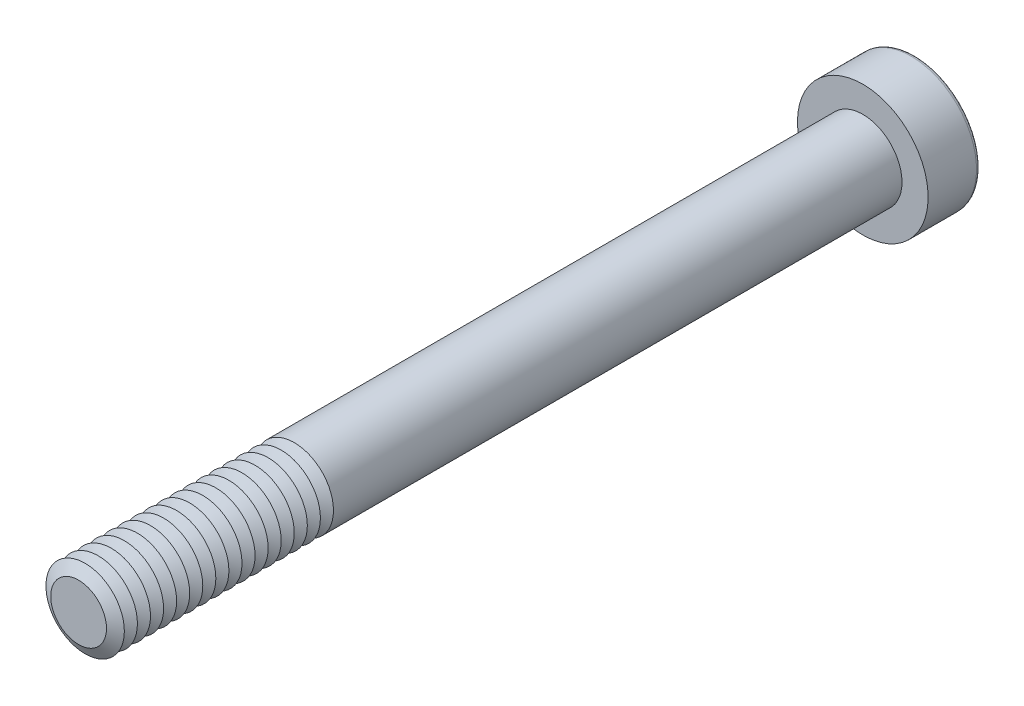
ISO-10303-21;
HEADER;
FILE_DESCRIPTION(('STEP AP214'),'2;1');
FILE_NAME('part.step','',(''),(''),'','','');
FILE_SCHEMA(('AUTOMOTIVE_DESIGN { 1 0 10303 214 1 1 1 1 }'));
ENDSEC;
DATA;
#1=APPLICATION_CONTEXT('core data for automotive mechanical design processes');
#2=APPLICATION_PROTOCOL_DEFINITION('international standard','automotive_design',2000,#1);
#3=PRODUCT_CONTEXT('',#1,'mechanical');
#4=PRODUCT('Part','Part','',(#3));
#5=PRODUCT_RELATED_PRODUCT_CATEGORY('part','',(#4));
#6=PRODUCT_DEFINITION_FORMATION('','',#4);
#7=PRODUCT_DEFINITION_CONTEXT('part definition',#1,'design');
#8=PRODUCT_DEFINITION('design','',#6,#7);
#9=PRODUCT_DEFINITION_SHAPE('','',#8);
#10=(LENGTH_UNIT() NAMED_UNIT(*) SI_UNIT(.MILLI.,.METRE.));
#11=(NAMED_UNIT(*) PLANE_ANGLE_UNIT() SI_UNIT($,.RADIAN.));
#12=(NAMED_UNIT(*) SI_UNIT($,.STERADIAN.) SOLID_ANGLE_UNIT());
#13=UNCERTAINTY_MEASURE_WITH_UNIT(LENGTH_MEASURE(1.E-05),#10,'distance_accuracy_value','');
#14=(GEOMETRIC_REPRESENTATION_CONTEXT(3) GLOBAL_UNCERTAINTY_ASSIGNED_CONTEXT((#13)) GLOBAL_UNIT_ASSIGNED_CONTEXT((#10,
#11,#12)) REPRESENTATION_CONTEXT('',''));
#15=CARTESIAN_POINT('',(0.,0.,0.));
#16=DIRECTION('',(0.,0.,1.));
#17=DIRECTION('',(1.,0.,0.));
#18=AXIS2_PLACEMENT_3D('',#15,#16,#17);
#19=CARTESIAN_POINT('',(0.,0.,56.5));
#20=DIRECTION('',(0.,0.,1.));
#21=DIRECTION('',(1.,0.,0.));
#22=AXIS2_PLACEMENT_3D('',#19,#20,#21);
#23=CONICAL_SURFACE('',#22,3.,1.0471975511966);
#24=CARTESIAN_POINT('',(0.,0.,56.));
#25=DIRECTION('',(0.,0.,1.));
#26=DIRECTION('',(1.,0.,0.));
#27=AXIS2_PLACEMENT_3D('',#24,#25,#26);
#28=CIRCLE('',#27,2.13397459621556);
#29=CARTESIAN_POINT('',(2.13397459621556,0.,56.));
#30=VERTEX_POINT('',#29);
#31=EDGE_CURVE('E313',#30,#30,#28,.T.);
#32=ORIENTED_EDGE('',*,*,#31,.T.);
#33=EDGE_LOOP('',(#32));
#34=FACE_BOUND('',#33,.T.);
#35=CARTESIAN_POINT('',(0.,0.,56.5));
#36=DIRECTION('',(0.,0.,1.));
#37=DIRECTION('',(1.,0.,0.));
#38=AXIS2_PLACEMENT_3D('',#35,#36,#37);
#39=CIRCLE('',#38,3.);
#40=CARTESIAN_POINT('',(3.,0.,56.5));
#41=VERTEX_POINT('',#40);
#42=EDGE_CURVE('E315',#41,#41,#39,.T.);
#43=ORIENTED_EDGE('',*,*,#42,.F.);
#44=EDGE_LOOP('',(#43));
#45=FACE_BOUND('',#44,.T.);
#46=ADVANCED_FACE('F39',(#34,#45),#23,.T.);
#47=CARTESIAN_POINT('',(0.,0.,56.));
#48=DIRECTION('',(0.,0.,-1.));
#49=DIRECTION('',(-1.,0.,0.));
#50=AXIS2_PLACEMENT_3D('',#47,#48,#49);
#51=CONICAL_SURFACE('',#50,2.13397459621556,1.0471975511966);
#52=CARTESIAN_POINT('',(0.,0.,55.5));
#53=DIRECTION('',(0.,0.,1.));
#54=DIRECTION('',(1.,0.,0.));
#55=AXIS2_PLACEMENT_3D('',#52,#53,#54);
#56=CIRCLE('',#55,3.);
#57=CARTESIAN_POINT('',(3.,0.,55.5));
#58=VERTEX_POINT('',#57);
#59=EDGE_CURVE('E323',#58,#58,#56,.T.);
#60=ORIENTED_EDGE('',*,*,#59,.T.);
#61=EDGE_LOOP('',(#60));
#62=FACE_BOUND('',#61,.T.);
#63=ORIENTED_EDGE('',*,*,#31,.F.);
#64=EDGE_LOOP('',(#63));
#65=FACE_BOUND('',#64,.T.);
#66=ADVANCED_FACE('F245',(#62,#65),#51,.T.);
#67=CARTESIAN_POINT('',(0.,0.,60.));
#68=DIRECTION('',(0.,0.,1.));
#69=DIRECTION('',(1.,0.,0.));
#70=AXIS2_PLACEMENT_3D('',#67,#68,#69);
#71=PLANE('',#70);
#72=CARTESIAN_POINT('',(0.,0.,60.));
#73=DIRECTION('',(0.,0.,1.));
#74=DIRECTION('',(1.,0.,0.));
#75=AXIS2_PLACEMENT_3D('',#72,#73,#74);
#76=CIRCLE('',#75,2.13397459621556);
#77=CARTESIAN_POINT('',(2.13397459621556,0.,60.));
#78=VERTEX_POINT('',#77);
#79=EDGE_CURVE('E174',#78,#78,#76,.T.);
#80=ORIENTED_EDGE('',*,*,#79,.T.);
#81=EDGE_LOOP('',(#80));
#82=FACE_BOUND('',#81,.T.);
#83=ADVANCED_FACE('F251',(#82),#71,.T.);
#84=CARTESIAN_POINT('',(0.,0.,60.));
#85=DIRECTION('',(0.,0.,-1.));
#86=DIRECTION('',(-1.,0.,0.));
#87=AXIS2_PLACEMENT_3D('',#84,#85,#86);
#88=CONICAL_SURFACE('',#87,2.13397459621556,1.0471975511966);
#89=CARTESIAN_POINT('',(0.,0.,59.5));
#90=DIRECTION('',(0.,0.,1.));
#91=DIRECTION('',(1.,0.,0.));
#92=AXIS2_PLACEMENT_3D('',#89,#90,#91);
#93=CIRCLE('',#92,3.);
#94=CARTESIAN_POINT('',(3.,0.,59.5));
#95=VERTEX_POINT('',#94);
#96=EDGE_CURVE('E291',#95,#95,#93,.T.);
#97=ORIENTED_EDGE('',*,*,#96,.T.);
#98=EDGE_LOOP('',(#97));
#99=FACE_BOUND('',#98,.T.);
#100=ORIENTED_EDGE('',*,*,#79,.F.);
#101=EDGE_LOOP('',(#100));
#102=FACE_BOUND('',#101,.T.);
#103=ADVANCED_FACE('F199',(#99,#102),#88,.T.);
#104=CARTESIAN_POINT('',(0.,0.,59.5));
#105=DIRECTION('',(0.,0.,1.));
#106=DIRECTION('',(1.,0.,0.));
#107=AXIS2_PLACEMENT_3D('',#104,#105,#106);
#108=CONICAL_SURFACE('',#107,3.,1.0471975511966);
#109=CARTESIAN_POINT('',(0.,0.,59.));
#110=DIRECTION('',(0.,0.,1.));
#111=DIRECTION('',(1.,0.,0.));
#112=AXIS2_PLACEMENT_3D('',#109,#110,#111);
#113=CIRCLE('',#112,2.13397459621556);
#114=CARTESIAN_POINT('',(2.13397459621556,0.,59.));
#115=VERTEX_POINT('',#114);
#116=EDGE_CURVE('E288',#115,#115,#113,.T.);
#117=ORIENTED_EDGE('',*,*,#116,.T.);
#118=EDGE_LOOP('',(#117));
#119=FACE_BOUND('',#118,.T.);
#120=ORIENTED_EDGE('',*,*,#96,.F.);
#121=EDGE_LOOP('',(#120));
#122=FACE_BOUND('',#121,.T.);
#123=ADVANCED_FACE('F277',(#119,#122),#108,.T.);
#124=CARTESIAN_POINT('',(0.,0.,59.));
#125=DIRECTION('',(0.,0.,-1.));
#126=DIRECTION('',(-1.,0.,0.));
#127=AXIS2_PLACEMENT_3D('',#124,#125,#126);
#128=CONICAL_SURFACE('',#127,2.13397459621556,1.0471975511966);
#129=CARTESIAN_POINT('',(0.,0.,58.5));
#130=DIRECTION('',(0.,0.,1.));
#131=DIRECTION('',(1.,0.,0.));
#132=AXIS2_PLACEMENT_3D('',#129,#130,#131);
#133=CIRCLE('',#132,3.);
#134=CARTESIAN_POINT('',(3.,0.,58.5));
#135=VERTEX_POINT('',#134);
#136=EDGE_CURVE('E300',#135,#135,#133,.T.);
#137=ORIENTED_EDGE('',*,*,#136,.T.);
#138=EDGE_LOOP('',(#137));
#139=FACE_BOUND('',#138,.T.);
#140=ORIENTED_EDGE('',*,*,#116,.F.);
#141=EDGE_LOOP('',(#140));
#142=FACE_BOUND('',#141,.T.);
#143=ADVANCED_FACE('F274',(#139,#142),#128,.T.);
#144=CARTESIAN_POINT('',(0.,0.,58.5));
#145=DIRECTION('',(0.,0.,1.));
#146=DIRECTION('',(1.,0.,0.));
#147=AXIS2_PLACEMENT_3D('',#144,#145,#146);
#148=CONICAL_SURFACE('',#147,3.,1.0471975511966);
#149=CARTESIAN_POINT('',(0.,0.,58.));
#150=DIRECTION('',(0.,0.,1.));
#151=DIRECTION('',(1.,0.,0.));
#152=AXIS2_PLACEMENT_3D('',#149,#150,#151);
#153=CIRCLE('',#152,2.13397459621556);
#154=CARTESIAN_POINT('',(2.13397459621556,0.,58.));
#155=VERTEX_POINT('',#154);
#156=EDGE_CURVE('E293',#155,#155,#153,.T.);
#157=ORIENTED_EDGE('',*,*,#156,.T.);
#158=EDGE_LOOP('',(#157));
#159=FACE_BOUND('',#158,.T.);
#160=ORIENTED_EDGE('',*,*,#136,.F.);
#161=EDGE_LOOP('',(#160));
#162=FACE_BOUND('',#161,.T.);
#163=ADVANCED_FACE('F270',(#159,#162),#148,.T.);
#164=CARTESIAN_POINT('',(0.,0.,58.));
#165=DIRECTION('',(0.,0.,-1.));
#166=DIRECTION('',(-1.,0.,0.));
#167=AXIS2_PLACEMENT_3D('',#164,#165,#166);
#168=CONICAL_SURFACE('',#167,2.13397459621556,1.0471975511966);
#169=CARTESIAN_POINT('',(0.,0.,57.5));
#170=DIRECTION('',(0.,0.,1.));
#171=DIRECTION('',(1.,0.,0.));
#172=AXIS2_PLACEMENT_3D('',#169,#170,#171);
#173=CIRCLE('',#172,3.);
#174=CARTESIAN_POINT('',(3.,0.,57.5));
#175=VERTEX_POINT('',#174);
#176=EDGE_CURVE('E309',#175,#175,#173,.T.);
#177=ORIENTED_EDGE('',*,*,#176,.T.);
#178=EDGE_LOOP('',(#177));
#179=FACE_BOUND('',#178,.T.);
#180=ORIENTED_EDGE('',*,*,#156,.F.);
#181=EDGE_LOOP('',(#180));
#182=FACE_BOUND('',#181,.T.);
#183=ADVANCED_FACE('F266',(#179,#182),#168,.T.);
#184=CARTESIAN_POINT('',(0.,0.,57.5));
#185=DIRECTION('',(0.,0.,1.));
#186=DIRECTION('',(1.,0.,0.));
#187=AXIS2_PLACEMENT_3D('',#184,#185,#186);
#188=CONICAL_SURFACE('',#187,3.,1.0471975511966);
#189=CARTESIAN_POINT('',(0.,0.,57.));
#190=DIRECTION('',(0.,0.,1.));
#191=DIRECTION('',(1.,0.,0.));
#192=AXIS2_PLACEMENT_3D('',#189,#190,#191);
#193=CIRCLE('',#192,2.13397459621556);
#194=CARTESIAN_POINT('',(2.13397459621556,0.,57.));
#195=VERTEX_POINT('',#194);
#196=EDGE_CURVE('E306',#195,#195,#193,.T.);
#197=ORIENTED_EDGE('',*,*,#196,.T.);
#198=EDGE_LOOP('',(#197));
#199=FACE_BOUND('',#198,.T.);
#200=ORIENTED_EDGE('',*,*,#176,.F.);
#201=EDGE_LOOP('',(#200));
#202=FACE_BOUND('',#201,.T.);
#203=ADVANCED_FACE('F262',(#199,#202),#188,.T.);
#204=CARTESIAN_POINT('',(0.,0.,57.));
#205=DIRECTION('',(0.,0.,-1.));
#206=DIRECTION('',(-1.,0.,0.));
#207=AXIS2_PLACEMENT_3D('',#204,#205,#206);
#208=CONICAL_SURFACE('',#207,2.13397459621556,1.0471975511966);
#209=ORIENTED_EDGE('',*,*,#42,.T.);
#210=EDGE_LOOP('',(#209));
#211=FACE_BOUND('',#210,.T.);
#212=ORIENTED_EDGE('',*,*,#196,.F.);
#213=EDGE_LOOP('',(#212));
#214=FACE_BOUND('',#213,.T.);
#215=ADVANCED_FACE('F258',(#211,#214),#208,.T.);
#216=CARTESIAN_POINT('',(0.,0.,55.5));
#217=DIRECTION('',(0.,0.,1.));
#218=DIRECTION('',(1.,0.,0.));
#219=AXIS2_PLACEMENT_3D('',#216,#217,#218);
#220=CONICAL_SURFACE('',#219,3.,1.0471975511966);
#221=CARTESIAN_POINT('',(0.,0.,55.));
#222=DIRECTION('',(0.,0.,1.));
#223=DIRECTION('',(1.,0.,0.));
#224=AXIS2_PLACEMENT_3D('',#221,#222,#223);
#225=CIRCLE('',#224,2.13397459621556);
#226=CARTESIAN_POINT('',(2.13397459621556,0.,55.));
#227=VERTEX_POINT('',#226);
#228=EDGE_CURVE('E319',#227,#227,#225,.T.);
#229=ORIENTED_EDGE('',*,*,#228,.T.);
#230=EDGE_LOOP('',(#229));
#231=FACE_BOUND('',#230,.T.);
#232=ORIENTED_EDGE('',*,*,#59,.F.);
#233=EDGE_LOOP('',(#232));
#234=FACE_BOUND('',#233,.T.);
#235=ADVANCED_FACE('F261',(#231,#234),#220,.T.);
#236=CARTESIAN_POINT('',(0.,0.,55.));
#237=DIRECTION('',(0.,0.,-1.));
#238=DIRECTION('',(-1.,0.,0.));
#239=AXIS2_PLACEMENT_3D('',#236,#237,#238);
#240=CONICAL_SURFACE('',#239,2.13397459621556,1.0471975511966);
#241=CARTESIAN_POINT('',(0.,0.,54.5));
#242=DIRECTION('',(0.,0.,1.));
#243=DIRECTION('',(1.,0.,0.));
#244=AXIS2_PLACEMENT_3D('',#241,#242,#243);
#245=CIRCLE('',#244,3.);
#246=CARTESIAN_POINT('',(3.,0.,54.5));
#247=VERTEX_POINT('',#246);
#248=EDGE_CURVE('E331',#247,#247,#245,.T.);
#249=ORIENTED_EDGE('',*,*,#248,.T.);
#250=EDGE_LOOP('',(#249));
#251=FACE_BOUND('',#250,.T.);
#252=ORIENTED_EDGE('',*,*,#228,.F.);
#253=EDGE_LOOP('',(#252));
#254=FACE_BOUND('',#253,.T.);
#255=ADVANCED_FACE('F511',(#251,#254),#240,.T.);
#256=CARTESIAN_POINT('',(0.,0.,54.5));
#257=DIRECTION('',(0.,0.,1.));
#258=DIRECTION('',(1.,0.,0.));
#259=AXIS2_PLACEMENT_3D('',#256,#257,#258);
#260=CONICAL_SURFACE('',#259,3.,1.0471975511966);
#261=CARTESIAN_POINT('',(0.,0.,54.));
#262=DIRECTION('',(0.,0.,1.));
#263=DIRECTION('',(1.,0.,0.));
#264=AXIS2_PLACEMENT_3D('',#261,#262,#263);
#265=CIRCLE('',#264,2.13397459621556);
#266=CARTESIAN_POINT('',(2.13397459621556,0.,54.));
#267=VERTEX_POINT('',#266);
#268=EDGE_CURVE('E327',#267,#267,#265,.T.);
#269=ORIENTED_EDGE('',*,*,#268,.T.);
#270=EDGE_LOOP('',(#269));
#271=FACE_BOUND('',#270,.T.);
#272=ORIENTED_EDGE('',*,*,#248,.F.);
#273=EDGE_LOOP('',(#272));
#274=FACE_BOUND('',#273,.T.);
#275=ADVANCED_FACE('F507',(#271,#274),#260,.T.);
#276=CARTESIAN_POINT('',(0.,0.,54.));
#277=DIRECTION('',(0.,0.,-1.));
#278=DIRECTION('',(-1.,0.,0.));
#279=AXIS2_PLACEMENT_3D('',#276,#277,#278);
#280=CONICAL_SURFACE('',#279,2.13397459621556,1.0471975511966);
#281=CARTESIAN_POINT('',(0.,0.,53.5));
#282=DIRECTION('',(0.,0.,1.));
#283=DIRECTION('',(1.,0.,0.));
#284=AXIS2_PLACEMENT_3D('',#281,#282,#283);
#285=CIRCLE('',#284,3.);
#286=CARTESIAN_POINT('',(3.,0.,53.5));
#287=VERTEX_POINT('',#286);
#288=EDGE_CURVE('E339',#287,#287,#285,.T.);
#289=ORIENTED_EDGE('',*,*,#288,.T.);
#290=EDGE_LOOP('',(#289));
#291=FACE_BOUND('',#290,.T.);
#292=ORIENTED_EDGE('',*,*,#268,.F.);
#293=EDGE_LOOP('',(#292));
#294=FACE_BOUND('',#293,.T.);
#295=ADVANCED_FACE('F503',(#291,#294),#280,.T.);
#296=CARTESIAN_POINT('',(0.,0.,53.5));
#297=DIRECTION('',(0.,0.,1.));
#298=DIRECTION('',(1.,0.,0.));
#299=AXIS2_PLACEMENT_3D('',#296,#297,#298);
#300=CONICAL_SURFACE('',#299,3.,1.0471975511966);
#301=CARTESIAN_POINT('',(0.,0.,53.));
#302=DIRECTION('',(0.,0.,1.));
#303=DIRECTION('',(1.,0.,0.));
#304=AXIS2_PLACEMENT_3D('',#301,#302,#303);
#305=CIRCLE('',#304,2.13397459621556);
#306=CARTESIAN_POINT('',(2.13397459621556,0.,53.));
#307=VERTEX_POINT('',#306);
#308=EDGE_CURVE('E335',#307,#307,#305,.T.);
#309=ORIENTED_EDGE('',*,*,#308,.T.);
#310=EDGE_LOOP('',(#309));
#311=FACE_BOUND('',#310,.T.);
#312=ORIENTED_EDGE('',*,*,#288,.F.);
#313=EDGE_LOOP('',(#312));
#314=FACE_BOUND('',#313,.T.);
#315=ADVANCED_FACE('F499',(#311,#314),#300,.T.);
#316=CARTESIAN_POINT('',(0.,0.,53.));
#317=DIRECTION('',(0.,0.,-1.));
#318=DIRECTION('',(-1.,0.,0.));
#319=AXIS2_PLACEMENT_3D('',#316,#317,#318);
#320=CONICAL_SURFACE('',#319,2.13397459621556,1.0471975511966);
#321=CARTESIAN_POINT('',(0.,0.,52.5));
#322=DIRECTION('',(0.,0.,1.));
#323=DIRECTION('',(1.,0.,0.));
#324=AXIS2_PLACEMENT_3D('',#321,#322,#323);
#325=CIRCLE('',#324,3.);
#326=CARTESIAN_POINT('',(3.,0.,52.5));
#327=VERTEX_POINT('',#326);
#328=EDGE_CURVE('E347',#327,#327,#325,.T.);
#329=ORIENTED_EDGE('',*,*,#328,.T.);
#330=EDGE_LOOP('',(#329));
#331=FACE_BOUND('',#330,.T.);
#332=ORIENTED_EDGE('',*,*,#308,.F.);
#333=EDGE_LOOP('',(#332));
#334=FACE_BOUND('',#333,.T.);
#335=ADVANCED_FACE('F495',(#331,#334),#320,.T.);
#336=CARTESIAN_POINT('',(0.,0.,52.5));
#337=DIRECTION('',(0.,0.,1.));
#338=DIRECTION('',(1.,0.,0.));
#339=AXIS2_PLACEMENT_3D('',#336,#337,#338);
#340=CONICAL_SURFACE('',#339,3.,1.0471975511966);
#341=CARTESIAN_POINT('',(0.,0.,52.));
#342=DIRECTION('',(0.,0.,1.));
#343=DIRECTION('',(1.,0.,0.));
#344=AXIS2_PLACEMENT_3D('',#341,#342,#343);
#345=CIRCLE('',#344,2.13397459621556);
#346=CARTESIAN_POINT('',(2.13397459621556,0.,52.));
#347=VERTEX_POINT('',#346);
#348=EDGE_CURVE('E343',#347,#347,#345,.T.);
#349=ORIENTED_EDGE('',*,*,#348,.T.);
#350=EDGE_LOOP('',(#349));
#351=FACE_BOUND('',#350,.T.);
#352=ORIENTED_EDGE('',*,*,#328,.F.);
#353=EDGE_LOOP('',(#352));
#354=FACE_BOUND('',#353,.T.);
#355=ADVANCED_FACE('F491',(#351,#354),#340,.T.);
#356=CARTESIAN_POINT('',(0.,0.,52.));
#357=DIRECTION('',(0.,0.,-1.));
#358=DIRECTION('',(-1.,0.,0.));
#359=AXIS2_PLACEMENT_3D('',#356,#357,#358);
#360=CONICAL_SURFACE('',#359,2.13397459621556,1.0471975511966);
#361=CARTESIAN_POINT('',(0.,0.,51.5));
#362=DIRECTION('',(0.,0.,1.));
#363=DIRECTION('',(1.,0.,0.));
#364=AXIS2_PLACEMENT_3D('',#361,#362,#363);
#365=CIRCLE('',#364,3.);
#366=CARTESIAN_POINT('',(3.,0.,51.5));
#367=VERTEX_POINT('',#366);
#368=EDGE_CURVE('E355',#367,#367,#365,.T.);
#369=ORIENTED_EDGE('',*,*,#368,.T.);
#370=EDGE_LOOP('',(#369));
#371=FACE_BOUND('',#370,.T.);
#372=ORIENTED_EDGE('',*,*,#348,.F.);
#373=EDGE_LOOP('',(#372));
#374=FACE_BOUND('',#373,.T.);
#375=ADVANCED_FACE('F487',(#371,#374),#360,.T.);
#376=CARTESIAN_POINT('',(0.,0.,51.5));
#377=DIRECTION('',(0.,0.,1.));
#378=DIRECTION('',(1.,0.,0.));
#379=AXIS2_PLACEMENT_3D('',#376,#377,#378);
#380=CONICAL_SURFACE('',#379,3.,1.0471975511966);
#381=CARTESIAN_POINT('',(0.,0.,51.));
#382=DIRECTION('',(0.,0.,1.));
#383=DIRECTION('',(1.,0.,0.));
#384=AXIS2_PLACEMENT_3D('',#381,#382,#383);
#385=CIRCLE('',#384,2.13397459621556);
#386=CARTESIAN_POINT('',(2.13397459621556,0.,51.));
#387=VERTEX_POINT('',#386);
#388=EDGE_CURVE('E351',#387,#387,#385,.T.);
#389=ORIENTED_EDGE('',*,*,#388,.T.);
#390=EDGE_LOOP('',(#389));
#391=FACE_BOUND('',#390,.T.);
#392=ORIENTED_EDGE('',*,*,#368,.F.);
#393=EDGE_LOOP('',(#392));
#394=FACE_BOUND('',#393,.T.);
#395=ADVANCED_FACE('F483',(#391,#394),#380,.T.);
#396=CARTESIAN_POINT('',(0.,0.,51.));
#397=DIRECTION('',(0.,0.,-1.));
#398=DIRECTION('',(-1.,0.,0.));
#399=AXIS2_PLACEMENT_3D('',#396,#397,#398);
#400=CONICAL_SURFACE('',#399,2.13397459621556,1.0471975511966);
#401=CARTESIAN_POINT('',(0.,0.,50.5));
#402=DIRECTION('',(0.,0.,1.));
#403=DIRECTION('',(1.,0.,0.));
#404=AXIS2_PLACEMENT_3D('',#401,#402,#403);
#405=CIRCLE('',#404,3.);
#406=CARTESIAN_POINT('',(3.,0.,50.5));
#407=VERTEX_POINT('',#406);
#408=EDGE_CURVE('E363',#407,#407,#405,.T.);
#409=ORIENTED_EDGE('',*,*,#408,.T.);
#410=EDGE_LOOP('',(#409));
#411=FACE_BOUND('',#410,.T.);
#412=ORIENTED_EDGE('',*,*,#388,.F.);
#413=EDGE_LOOP('',(#412));
#414=FACE_BOUND('',#413,.T.);
#415=ADVANCED_FACE('F479',(#411,#414),#400,.T.);
#416=CARTESIAN_POINT('',(0.,0.,50.5));
#417=DIRECTION('',(0.,0.,1.));
#418=DIRECTION('',(1.,0.,0.));
#419=AXIS2_PLACEMENT_3D('',#416,#417,#418);
#420=CONICAL_SURFACE('',#419,3.,1.0471975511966);
#421=CARTESIAN_POINT('',(0.,0.,50.));
#422=DIRECTION('',(0.,0.,1.));
#423=DIRECTION('',(1.,0.,0.));
#424=AXIS2_PLACEMENT_3D('',#421,#422,#423);
#425=CIRCLE('',#424,2.13397459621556);
#426=CARTESIAN_POINT('',(2.13397459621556,0.,50.));
#427=VERTEX_POINT('',#426);
#428=EDGE_CURVE('E359',#427,#427,#425,.T.);
#429=ORIENTED_EDGE('',*,*,#428,.T.);
#430=EDGE_LOOP('',(#429));
#431=FACE_BOUND('',#430,.T.);
#432=ORIENTED_EDGE('',*,*,#408,.F.);
#433=EDGE_LOOP('',(#432));
#434=FACE_BOUND('',#433,.T.);
#435=ADVANCED_FACE('F475',(#431,#434),#420,.T.);
#436=CARTESIAN_POINT('',(0.,0.,50.));
#437=DIRECTION('',(0.,0.,-1.));
#438=DIRECTION('',(-1.,0.,0.));
#439=AXIS2_PLACEMENT_3D('',#436,#437,#438);
#440=CONICAL_SURFACE('',#439,2.13397459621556,1.0471975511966);
#441=CARTESIAN_POINT('',(0.,0.,49.5));
#442=DIRECTION('',(0.,0.,1.));
#443=DIRECTION('',(1.,0.,0.));
#444=AXIS2_PLACEMENT_3D('',#441,#442,#443);
#445=CIRCLE('',#444,3.);
#446=CARTESIAN_POINT('',(3.,0.,49.5));
#447=VERTEX_POINT('',#446);
#448=EDGE_CURVE('E371',#447,#447,#445,.T.);
#449=ORIENTED_EDGE('',*,*,#448,.T.);
#450=EDGE_LOOP('',(#449));
#451=FACE_BOUND('',#450,.T.);
#452=ORIENTED_EDGE('',*,*,#428,.F.);
#453=EDGE_LOOP('',(#452));
#454=FACE_BOUND('',#453,.T.);
#455=ADVANCED_FACE('F471',(#451,#454),#440,.T.);
#456=CARTESIAN_POINT('',(0.,0.,49.5));
#457=DIRECTION('',(0.,0.,1.));
#458=DIRECTION('',(1.,0.,0.));
#459=AXIS2_PLACEMENT_3D('',#456,#457,#458);
#460=CONICAL_SURFACE('',#459,3.,1.0471975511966);
#461=CARTESIAN_POINT('',(0.,0.,49.));
#462=DIRECTION('',(0.,0.,1.));
#463=DIRECTION('',(1.,0.,0.));
#464=AXIS2_PLACEMENT_3D('',#461,#462,#463);
#465=CIRCLE('',#464,2.13397459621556);
#466=CARTESIAN_POINT('',(2.13397459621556,0.,49.));
#467=VERTEX_POINT('',#466);
#468=EDGE_CURVE('E367',#467,#467,#465,.T.);
#469=ORIENTED_EDGE('',*,*,#468,.T.);
#470=EDGE_LOOP('',(#469));
#471=FACE_BOUND('',#470,.T.);
#472=ORIENTED_EDGE('',*,*,#448,.F.);
#473=EDGE_LOOP('',(#472));
#474=FACE_BOUND('',#473,.T.);
#475=ADVANCED_FACE('F467',(#471,#474),#460,.T.);
#476=CARTESIAN_POINT('',(0.,0.,49.));
#477=DIRECTION('',(0.,0.,-1.));
#478=DIRECTION('',(-1.,0.,0.));
#479=AXIS2_PLACEMENT_3D('',#476,#477,#478);
#480=CONICAL_SURFACE('',#479,2.13397459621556,1.0471975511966);
#481=CARTESIAN_POINT('',(0.,0.,48.5));
#482=DIRECTION('',(0.,0.,1.));
#483=DIRECTION('',(1.,0.,0.));
#484=AXIS2_PLACEMENT_3D('',#481,#482,#483);
#485=CIRCLE('',#484,3.);
#486=CARTESIAN_POINT('',(3.,0.,48.5));
#487=VERTEX_POINT('',#486);
#488=EDGE_CURVE('E379',#487,#487,#485,.T.);
#489=ORIENTED_EDGE('',*,*,#488,.T.);
#490=EDGE_LOOP('',(#489));
#491=FACE_BOUND('',#490,.T.);
#492=ORIENTED_EDGE('',*,*,#468,.F.);
#493=EDGE_LOOP('',(#492));
#494=FACE_BOUND('',#493,.T.);
#495=ADVANCED_FACE('F463',(#491,#494),#480,.T.);
#496=CARTESIAN_POINT('',(0.,0.,48.5));
#497=DIRECTION('',(0.,0.,1.));
#498=DIRECTION('',(1.,0.,0.));
#499=AXIS2_PLACEMENT_3D('',#496,#497,#498);
#500=CONICAL_SURFACE('',#499,3.,1.0471975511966);
#501=CARTESIAN_POINT('',(0.,0.,48.));
#502=DIRECTION('',(0.,0.,1.));
#503=DIRECTION('',(1.,0.,0.));
#504=AXIS2_PLACEMENT_3D('',#501,#502,#503);
#505=CIRCLE('',#504,2.13397459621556);
#506=CARTESIAN_POINT('',(2.13397459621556,0.,48.));
#507=VERTEX_POINT('',#506);
#508=EDGE_CURVE('E375',#507,#507,#505,.T.);
#509=ORIENTED_EDGE('',*,*,#508,.T.);
#510=EDGE_LOOP('',(#509));
#511=FACE_BOUND('',#510,.T.);
#512=ORIENTED_EDGE('',*,*,#488,.F.);
#513=EDGE_LOOP('',(#512));
#514=FACE_BOUND('',#513,.T.);
#515=ADVANCED_FACE('F459',(#511,#514),#500,.T.);
#516=CARTESIAN_POINT('',(0.,0.,48.));
#517=DIRECTION('',(0.,0.,-1.));
#518=DIRECTION('',(-1.,0.,0.));
#519=AXIS2_PLACEMENT_3D('',#516,#517,#518);
#520=CONICAL_SURFACE('',#519,2.13397459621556,1.0471975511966);
#521=CARTESIAN_POINT('',(0.,0.,47.5));
#522=DIRECTION('',(0.,0.,1.));
#523=DIRECTION('',(1.,0.,0.));
#524=AXIS2_PLACEMENT_3D('',#521,#522,#523);
#525=CIRCLE('',#524,3.);
#526=CARTESIAN_POINT('',(3.,0.,47.5));
#527=VERTEX_POINT('',#526);
#528=EDGE_CURVE('E387',#527,#527,#525,.T.);
#529=ORIENTED_EDGE('',*,*,#528,.T.);
#530=EDGE_LOOP('',(#529));
#531=FACE_BOUND('',#530,.T.);
#532=ORIENTED_EDGE('',*,*,#508,.F.);
#533=EDGE_LOOP('',(#532));
#534=FACE_BOUND('',#533,.T.);
#535=ADVANCED_FACE('F455',(#531,#534),#520,.T.);
#536=CARTESIAN_POINT('',(0.,0.,47.5));
#537=DIRECTION('',(0.,0.,1.));
#538=DIRECTION('',(1.,0.,0.));
#539=AXIS2_PLACEMENT_3D('',#536,#537,#538);
#540=CONICAL_SURFACE('',#539,3.,1.0471975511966);
#541=CARTESIAN_POINT('',(0.,0.,47.));
#542=DIRECTION('',(0.,0.,1.));
#543=DIRECTION('',(1.,0.,0.));
#544=AXIS2_PLACEMENT_3D('',#541,#542,#543);
#545=CIRCLE('',#544,2.13397459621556);
#546=CARTESIAN_POINT('',(2.13397459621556,0.,47.));
#547=VERTEX_POINT('',#546);
#548=EDGE_CURVE('E383',#547,#547,#545,.T.);
#549=ORIENTED_EDGE('',*,*,#548,.T.);
#550=EDGE_LOOP('',(#549));
#551=FACE_BOUND('',#550,.T.);
#552=ORIENTED_EDGE('',*,*,#528,.F.);
#553=EDGE_LOOP('',(#552));
#554=FACE_BOUND('',#553,.T.);
#555=ADVANCED_FACE('F451',(#551,#554),#540,.T.);
#556=CARTESIAN_POINT('',(0.,0.,47.));
#557=DIRECTION('',(0.,0.,-1.));
#558=DIRECTION('',(-1.,0.,0.));
#559=AXIS2_PLACEMENT_3D('',#556,#557,#558);
#560=CONICAL_SURFACE('',#559,2.13397459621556,1.0471975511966);
#561=CARTESIAN_POINT('',(0.,0.,46.5));
#562=DIRECTION('',(0.,0.,1.));
#563=DIRECTION('',(1.,0.,0.));
#564=AXIS2_PLACEMENT_3D('',#561,#562,#563);
#565=CIRCLE('',#564,3.);
#566=CARTESIAN_POINT('',(3.,0.,46.5));
#567=VERTEX_POINT('',#566);
#568=EDGE_CURVE('E395',#567,#567,#565,.T.);
#569=ORIENTED_EDGE('',*,*,#568,.T.);
#570=EDGE_LOOP('',(#569));
#571=FACE_BOUND('',#570,.T.);
#572=ORIENTED_EDGE('',*,*,#548,.F.);
#573=EDGE_LOOP('',(#572));
#574=FACE_BOUND('',#573,.T.);
#575=ADVANCED_FACE('F447',(#571,#574),#560,.T.);
#576=CARTESIAN_POINT('',(0.,0.,46.5));
#577=DIRECTION('',(0.,0.,1.));
#578=DIRECTION('',(1.,0.,0.));
#579=AXIS2_PLACEMENT_3D('',#576,#577,#578);
#580=CONICAL_SURFACE('',#579,3.,1.0471975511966);
#581=CARTESIAN_POINT('',(0.,0.,46.));
#582=DIRECTION('',(0.,0.,1.));
#583=DIRECTION('',(1.,0.,0.));
#584=AXIS2_PLACEMENT_3D('',#581,#582,#583);
#585=CIRCLE('',#584,2.13397459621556);
#586=CARTESIAN_POINT('',(2.13397459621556,0.,46.));
#587=VERTEX_POINT('',#586);
#588=EDGE_CURVE('E391',#587,#587,#585,.T.);
#589=ORIENTED_EDGE('',*,*,#588,.T.);
#590=EDGE_LOOP('',(#589));
#591=FACE_BOUND('',#590,.T.);
#592=ORIENTED_EDGE('',*,*,#568,.F.);
#593=EDGE_LOOP('',(#592));
#594=FACE_BOUND('',#593,.T.);
#595=ADVANCED_FACE('F443',(#591,#594),#580,.T.);
#596=CARTESIAN_POINT('',(0.,0.,46.));
#597=DIRECTION('',(0.,0.,-1.));
#598=DIRECTION('',(-1.,0.,0.));
#599=AXIS2_PLACEMENT_3D('',#596,#597,#598);
#600=CONICAL_SURFACE('',#599,2.13397459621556,1.0471975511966);
#601=CARTESIAN_POINT('',(0.,0.,45.5));
#602=DIRECTION('',(0.,0.,1.));
#603=DIRECTION('',(1.,0.,0.));
#604=AXIS2_PLACEMENT_3D('',#601,#602,#603);
#605=CIRCLE('',#604,3.);
#606=CARTESIAN_POINT('',(3.,0.,45.5));
#607=VERTEX_POINT('',#606);
#608=EDGE_CURVE('E403',#607,#607,#605,.T.);
#609=ORIENTED_EDGE('',*,*,#608,.T.);
#610=EDGE_LOOP('',(#609));
#611=FACE_BOUND('',#610,.T.);
#612=ORIENTED_EDGE('',*,*,#588,.F.);
#613=EDGE_LOOP('',(#612));
#614=FACE_BOUND('',#613,.T.);
#615=ADVANCED_FACE('F439',(#611,#614),#600,.T.);
#616=CARTESIAN_POINT('',(0.,0.,45.5));
#617=DIRECTION('',(0.,0.,1.));
#618=DIRECTION('',(1.,0.,0.));
#619=AXIS2_PLACEMENT_3D('',#616,#617,#618);
#620=CONICAL_SURFACE('',#619,3.,1.0471975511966);
#621=CARTESIAN_POINT('',(0.,0.,45.));
#622=DIRECTION('',(0.,0.,1.));
#623=DIRECTION('',(1.,0.,0.));
#624=AXIS2_PLACEMENT_3D('',#621,#622,#623);
#625=CIRCLE('',#624,2.13397459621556);
#626=CARTESIAN_POINT('',(2.13397459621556,0.,45.));
#627=VERTEX_POINT('',#626);
#628=EDGE_CURVE('E399',#627,#627,#625,.T.);
#629=ORIENTED_EDGE('',*,*,#628,.T.);
#630=EDGE_LOOP('',(#629));
#631=FACE_BOUND('',#630,.T.);
#632=ORIENTED_EDGE('',*,*,#608,.F.);
#633=EDGE_LOOP('',(#632));
#634=FACE_BOUND('',#633,.T.);
#635=ADVANCED_FACE('F434',(#631,#634),#620,.T.);
#636=CARTESIAN_POINT('',(0.,0.,45.));
#637=DIRECTION('',(0.,0.,-1.));
#638=DIRECTION('',(-1.,0.,0.));
#639=AXIS2_PLACEMENT_3D('',#636,#637,#638);
#640=CONICAL_SURFACE('',#639,2.13397459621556,1.0471975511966);
#641=CARTESIAN_POINT('',(0.,0.,44.5));
#642=DIRECTION('',(0.,0.,1.));
#643=DIRECTION('',(1.,0.,0.));
#644=AXIS2_PLACEMENT_3D('',#641,#642,#643);
#645=CIRCLE('',#644,3.);
#646=CARTESIAN_POINT('',(3.,0.,44.5));
#647=VERTEX_POINT('',#646);
#648=EDGE_CURVE('E415',#647,#647,#645,.T.);
#649=ORIENTED_EDGE('',*,*,#648,.T.);
#650=EDGE_LOOP('',(#649));
#651=FACE_BOUND('',#650,.T.);
#652=ORIENTED_EDGE('',*,*,#628,.F.);
#653=EDGE_LOOP('',(#652));
#654=FACE_BOUND('',#653,.T.);
#655=ADVANCED_FACE('F420',(#651,#654),#640,.T.);
#656=CARTESIAN_POINT('',(0.,0.,44.5));
#657=DIRECTION('',(0.,0.,1.));
#658=DIRECTION('',(1.,0.,0.));
#659=AXIS2_PLACEMENT_3D('',#656,#657,#658);
#660=CONICAL_SURFACE('',#659,3.,1.0471975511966);
#661=CARTESIAN_POINT('',(0.,0.,44.));
#662=DIRECTION('',(0.,0.,1.));
#663=DIRECTION('',(1.,0.,0.));
#664=AXIS2_PLACEMENT_3D('',#661,#662,#663);
#665=CIRCLE('',#664,2.13397459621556);
#666=CARTESIAN_POINT('',(2.13397459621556,0.,44.));
#667=VERTEX_POINT('',#666);
#668=EDGE_CURVE('E407',#667,#667,#665,.T.);
#669=ORIENTED_EDGE('',*,*,#668,.T.);
#670=EDGE_LOOP('',(#669));
#671=FACE_BOUND('',#670,.T.);
#672=ORIENTED_EDGE('',*,*,#648,.F.);
#673=EDGE_LOOP('',(#672));
#674=FACE_BOUND('',#673,.T.);
#675=ADVANCED_FACE('F423',(#671,#674),#660,.T.);
#676=CARTESIAN_POINT('',(0.,0.,44.));
#677=DIRECTION('',(0.,0.,-1.));
#678=DIRECTION('',(-1.,0.,0.));
#679=AXIS2_PLACEMENT_3D('',#676,#677,#678);
#680=CONICAL_SURFACE('',#679,2.13397459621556,1.0471975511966);
#681=CARTESIAN_POINT('',(0.,0.,43.5));
#682=DIRECTION('',(0.,0.,1.));
#683=DIRECTION('',(1.,0.,0.));
#684=AXIS2_PLACEMENT_3D('',#681,#682,#683);
#685=CIRCLE('',#684,3.);
#686=CARTESIAN_POINT('',(3.,0.,43.5));
#687=VERTEX_POINT('',#686);
#688=EDGE_CURVE('E411',#687,#687,#685,.T.);
#689=ORIENTED_EDGE('',*,*,#688,.T.);
#690=EDGE_LOOP('',(#689));
#691=FACE_BOUND('',#690,.T.);
#692=ORIENTED_EDGE('',*,*,#668,.F.);
#693=EDGE_LOOP('',(#692));
#694=FACE_BOUND('',#693,.T.);
#695=ADVANCED_FACE('F425',(#691,#694),#680,.T.);
#696=CARTESIAN_POINT('',(0.,0.,-1.));
#697=DIRECTION('',(0.,0.,-1.));
#698=DIRECTION('',(-1.,0.,0.));
#699=AXIS2_PLACEMENT_3D('',#696,#697,#698);
#700=CONICAL_SURFACE('',#699,2.,1.0471975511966);
#701=CARTESIAN_POINT('',(0.,0.,0.154700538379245));
#702=VERTEX_POINT('',#701);
#703=VERTEX_LOOP('',#702);
#704=FACE_BOUND('',#703,.T.);
#705=CARTESIAN_POINT('',(0.,0.,-1.));
#706=DIRECTION('',(0.,0.,-1.));
#707=DIRECTION('',(-1.,0.,0.));
#708=AXIS2_PLACEMENT_3D('',#705,#706,#707);
#709=CIRCLE('',#708,2.);
#710=CARTESIAN_POINT('',(-1.73205080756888,0.999999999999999,-1.));
#711=VERTEX_POINT('',#710);
#712=CARTESIAN_POINT('',(0.,2.,-1.));
#713=VERTEX_POINT('',#712);
#714=EDGE_CURVE('E149',#711,#713,#709,.T.);
#715=ORIENTED_EDGE('',*,*,#714,.T.);
#716=CARTESIAN_POINT('',(0.,0.,-1.));
#717=DIRECTION('',(0.,0.,-1.));
#718=DIRECTION('',(-1.,0.,0.));
#719=AXIS2_PLACEMENT_3D('',#716,#717,#718);
#720=CIRCLE('',#719,2.);
#721=CARTESIAN_POINT('',(1.73205080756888,1.,-1.));
#722=VERTEX_POINT('',#721);
#723=EDGE_CURVE('E54',#713,#722,#720,.T.);
#724=ORIENTED_EDGE('',*,*,#723,.T.);
#725=CARTESIAN_POINT('',(1.73205080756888,-0.999999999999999,-1.));
#726=VERTEX_POINT('',#725);
#727=EDGE_CURVE('E1028',#722,#726,#720,.T.);
#728=ORIENTED_EDGE('',*,*,#727,.T.);
#729=CARTESIAN_POINT('',(0.,-2.,-1.));
#730=VERTEX_POINT('',#729);
#731=EDGE_CURVE('E1026',#726,#730,#720,.T.);
#732=ORIENTED_EDGE('',*,*,#731,.T.);
#733=CARTESIAN_POINT('',(-1.73205080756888,-0.999999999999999,-1.));
#734=VERTEX_POINT('',#733);
#735=EDGE_CURVE('E1021',#730,#734,#720,.T.);
#736=ORIENTED_EDGE('',*,*,#735,.T.);
#737=EDGE_CURVE('E1019',#734,#711,#720,.T.);
#738=ORIENTED_EDGE('',*,*,#737,.T.);
#739=EDGE_LOOP('',(#715,#724,#728,#732,#736,#738));
#740=FACE_BOUND('',#739,.T.);
#741=ADVANCED_FACE('F201',(#704,#740),#700,.F.);
#742=CARTESIAN_POINT('',(0.,0.,-1.));
#743=DIRECTION('',(0.,0.,-1.));
#744=DIRECTION('',(-1.,0.,0.));
#745=AXIS2_PLACEMENT_3D('',#742,#743,#744);
#746=PLANE('',#745);
#747=ORIENTED_EDGE('',*,*,#723,.F.);
#748=DIRECTION('',(1.,0.,0.));
#749=VECTOR('',#748,1.);
#750=CARTESIAN_POINT('',(-1.15470053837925,2.,-1.));
#751=LINE('',#750,#749);
#752=CARTESIAN_POINT('',(1.15470053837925,2.,-1.));
#753=VERTEX_POINT('',#752);
#754=EDGE_CURVE('E1070',#713,#753,#751,.T.);
#755=ORIENTED_EDGE('',*,*,#754,.T.);
#756=DIRECTION('',(0.5,-0.866025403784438,0.));
#757=VECTOR('',#756,1.);
#758=CARTESIAN_POINT('',(1.15470053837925,2.,-1.));
#759=LINE('',#758,#757);
#760=EDGE_CURVE('E155',#753,#722,#759,.T.);
#761=ORIENTED_EDGE('',*,*,#760,.T.);
#762=EDGE_LOOP('',(#747,#755,#761));
#763=FACE_BOUND('',#762,.T.);
#764=ADVANCED_FACE('F606',(#763),#746,.T.);
#765=ORIENTED_EDGE('',*,*,#727,.F.);
#766=CARTESIAN_POINT('',(2.3094010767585,0.,-1.));
#767=VERTEX_POINT('',#766);
#768=EDGE_CURVE('E1065',#722,#767,#759,.T.);
#769=ORIENTED_EDGE('',*,*,#768,.T.);
#770=DIRECTION('',(-0.5,-0.866025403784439,0.));
#771=VECTOR('',#770,1.);
#772=CARTESIAN_POINT('',(2.3094010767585,0.,-1.));
#773=LINE('',#772,#771);
#774=EDGE_CURVE('E1041',#767,#726,#773,.T.);
#775=ORIENTED_EDGE('',*,*,#774,.T.);
#776=EDGE_LOOP('',(#765,#769,#775));
#777=FACE_BOUND('',#776,.T.);
#778=ADVANCED_FACE('F616',(#777),#746,.T.);
#779=ORIENTED_EDGE('',*,*,#731,.F.);
#780=CARTESIAN_POINT('',(1.15470053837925,-2.,-1.));
#781=VERTEX_POINT('',#780);
#782=EDGE_CURVE('E1043',#726,#781,#773,.T.);
#783=ORIENTED_EDGE('',*,*,#782,.T.);
#784=DIRECTION('',(-1.,0.,0.));
#785=VECTOR('',#784,1.);
#786=CARTESIAN_POINT('',(1.15470053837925,-2.,-1.));
#787=LINE('',#786,#785);
#788=EDGE_CURVE('E992',#781,#730,#787,.T.);
#789=ORIENTED_EDGE('',*,*,#788,.T.);
#790=EDGE_LOOP('',(#779,#783,#789));
#791=FACE_BOUND('',#790,.T.);
#792=ADVANCED_FACE('F626',(#791),#746,.T.);
#793=ORIENTED_EDGE('',*,*,#735,.F.);
#794=CARTESIAN_POINT('',(-1.15470053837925,-2.,-1.));
#795=VERTEX_POINT('',#794);
#796=EDGE_CURVE('E1037',#730,#795,#787,.T.);
#797=ORIENTED_EDGE('',*,*,#796,.T.);
#798=DIRECTION('',(-0.5,0.866025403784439,0.));
#799=VECTOR('',#798,1.);
#800=CARTESIAN_POINT('',(-1.15470053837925,-2.,-1.));
#801=LINE('',#800,#799);
#802=EDGE_CURVE('E1039',#795,#734,#801,.T.);
#803=ORIENTED_EDGE('',*,*,#802,.T.);
#804=EDGE_LOOP('',(#793,#797,#803));
#805=FACE_BOUND('',#804,.T.);
#806=ADVANCED_FACE('F634',(#805),#746,.T.);
#807=ORIENTED_EDGE('',*,*,#737,.F.);
#808=CARTESIAN_POINT('',(-2.3094010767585,0.,-1.));
#809=VERTEX_POINT('',#808);
#810=EDGE_CURVE('E1044',#734,#809,#801,.T.);
#811=ORIENTED_EDGE('',*,*,#810,.T.);
#812=DIRECTION('',(0.5,0.866025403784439,0.));
#813=VECTOR('',#812,1.);
#814=CARTESIAN_POINT('',(-2.3094010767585,0.,-1.));
#815=LINE('',#814,#813);
#816=EDGE_CURVE('E158',#809,#711,#815,.T.);
#817=ORIENTED_EDGE('',*,*,#816,.T.);
#818=EDGE_LOOP('',(#807,#811,#817));
#819=FACE_BOUND('',#818,.T.);
#820=ADVANCED_FACE('F231',(#819),#746,.T.);
#821=ORIENTED_EDGE('',*,*,#714,.F.);
#822=CARTESIAN_POINT('',(-1.15470053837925,2.,-1.));
#823=VERTEX_POINT('',#822);
#824=EDGE_CURVE('E1052',#711,#823,#815,.T.);
#825=ORIENTED_EDGE('',*,*,#824,.T.);
#826=EDGE_CURVE('E1067',#823,#713,#751,.T.);
#827=ORIENTED_EDGE('',*,*,#826,.T.);
#828=EDGE_LOOP('',(#821,#825,#827));
#829=FACE_BOUND('',#828,.T.);
#830=ADVANCED_FACE('F618',(#829),#746,.T.);
#831=CARTESIAN_POINT('',(-1.15470053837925,2.,-1.));
#832=DIRECTION('',(0.,1.,0.));
#833=DIRECTION('',(0.,0.,1.));
#834=AXIS2_PLACEMENT_3D('',#831,#832,#833);
#835=PLANE('',#834);
#836=DIRECTION('',(0.,0.,-1.));
#837=VECTOR('',#836,1.);
#838=CARTESIAN_POINT('',(-1.15470053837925,2.,-1.));
#839=LINE('',#838,#837);
#840=CARTESIAN_POINT('',(-1.15470053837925,2.,-4.));
#841=VERTEX_POINT('',#840);
#842=EDGE_CURVE('E147',#823,#841,#839,.T.);
#843=ORIENTED_EDGE('',*,*,#842,.T.);
#844=CARTESIAN_POINT('',(-3.01440758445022,2.,-4.35051689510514));
#845=CARTESIAN_POINT('',(-2.92409762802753,2.,-4.33035636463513));
#846=CARTESIAN_POINT('',(-2.83373054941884,2.,-4.31045254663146));
#847=CARTESIAN_POINT('',(-2.65285291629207,2.,-4.27128852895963));
#848=CARTESIAN_POINT('',(-2.562342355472,2.,-4.25202835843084));
#849=CARTESIAN_POINT('',(-2.29037985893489,2.,-4.19537300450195));
#850=CARTESIAN_POINT('',(-2.10868043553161,2.,-4.15914446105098));
#851=CARTESIAN_POINT('',(-1.74597297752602,2.,-4.09171688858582));
#852=CARTESIAN_POINT('',(-1.56497266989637,2.,-4.06047686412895));
#853=CARTESIAN_POINT('',(-1.20186568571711,2.,-4.00513826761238));
#854=CARTESIAN_POINT('',(-1.01975924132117,2.,-3.98103824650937));
#855=CARTESIAN_POINT('',(-0.744747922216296,2.,-3.9525901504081));
#856=CARTESIAN_POINT('',(-0.652245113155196,2.,-3.9443671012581));
#857=CARTESIAN_POINT('',(-0.467020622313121,2.,-3.93099406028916));
#858=CARTESIAN_POINT('',(-0.374298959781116,2.,-3.92584380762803));
#859=CARTESIAN_POINT('',(-0.188764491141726,2.,-3.91891540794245));
#860=CARTESIAN_POINT('',(-0.0959517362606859,2.,-3.91713591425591));
#861=CARTESIAN_POINT('',(0.0896753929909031,2.,-3.91705786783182));
#862=CARTESIAN_POINT('',(0.182489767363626,2.,-3.91875932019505));
#863=CARTESIAN_POINT('',(0.368369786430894,2.,-3.92554892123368));
#864=CARTESIAN_POINT('',(0.461434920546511,2.,-3.93065079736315));
#865=CARTESIAN_POINT('',(0.647346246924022,2.,-3.94395663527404));
#866=CARTESIAN_POINT('',(0.740192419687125,2.,-3.95216086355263));
#867=CARTESIAN_POINT('',(1.01841374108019,2.,-3.98081777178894));
#868=CARTESIAN_POINT('',(1.2033713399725,2.,-4.00531018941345));
#869=CARTESIAN_POINT('',(1.57694396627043,2.,-4.06236202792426));
#870=CARTESIAN_POINT('',(1.76552771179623,2.,-4.09511615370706));
#871=CARTESIAN_POINT('',(2.14178491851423,2.,-4.1655706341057));
#872=CARTESIAN_POINT('',(2.32945822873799,2.,-4.20327178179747));
#873=CARTESIAN_POINT('',(2.70417911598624,2.,-4.28188312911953));
#874=CARTESIAN_POINT('',(2.89122649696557,2.,-4.32279425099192));
#875=CARTESIAN_POINT('',(3.26484478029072,2.,-4.40674298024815));
#876=CARTESIAN_POINT('',(3.45141567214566,2.,-4.44978063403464));
#877=CARTESIAN_POINT('',(3.821938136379,2.,-4.53678178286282));
#878=CARTESIAN_POINT('',(4.00589388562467,2.,-4.58072756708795));
#879=CARTESIAN_POINT('',(4.37356350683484,2.,-4.66963526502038));
#880=CARTESIAN_POINT('',(4.55727737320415,2.,-4.71459720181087));
#881=CARTESIAN_POINT('',(4.9242660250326,2.,-4.80519833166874));
#882=CARTESIAN_POINT('',(5.10754106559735,2.,-4.85083649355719));
#883=CARTESIAN_POINT('',(5.47394280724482,2.,-4.94267693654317));
#884=CARTESIAN_POINT('',(5.65706951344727,2.,-4.98887919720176));
#885=CARTESIAN_POINT('',(5.84014583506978,2.,-5.03527803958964));
#886=B_SPLINE_CURVE_WITH_KNOTS('',3,(#844,#845,#846,#847,#848,#849,#850,#851,#852,#853,#854,
#855,#856,#857,#858,#859,#860,#861,#862,#863,#864,#865,#866,#867,#868,#869,#870,#871,#872,#873,
#874,#875,#876,#877,#878,#879,#880,#881,#882,#883,#884,#885),.UNSPECIFIED.,.F.,.F.,(4,2,2,2,2,2,
2,2,2,2,2,2,2,2,2,2,2,2,2,2,4),(0.,0.277597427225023,0.555207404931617,1.11099118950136,
1.66194208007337,2.21278108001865,2.49134108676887,2.76987744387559,3.04830249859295,
3.32672796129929,3.60628428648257,3.88586463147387,4.44532615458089,5.0194589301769,
5.59368385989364,6.16807437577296,6.74247743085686,7.30986991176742,7.87727529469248,
8.44388991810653,9.01048407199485),.UNSPECIFIED.);
#887=CARTESIAN_POINT('',(1.15470053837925,2.,-4.));
#888=VERTEX_POINT('',#887);
#889=EDGE_CURVE('E124',#841,#888,#886,.T.);
#890=ORIENTED_EDGE('',*,*,#889,.T.);
#891=DIRECTION('',(0.,0.,-1.));
#892=VECTOR('',#891,1.);
#893=CARTESIAN_POINT('',(1.15470053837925,2.,-1.));
#894=LINE('',#893,#892);
#895=EDGE_CURVE('E143',#753,#888,#894,.T.);
#896=ORIENTED_EDGE('',*,*,#895,.F.);
#897=ORIENTED_EDGE('',*,*,#754,.F.);
#898=ORIENTED_EDGE('',*,*,#826,.F.);
#899=EDGE_LOOP('',(#843,#890,#896,#897,#898));
#900=FACE_BOUND('',#899,.T.);
#901=ADVANCED_FACE('F141',(#900),#835,.F.);
#902=CARTESIAN_POINT('',(1.15470053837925,2.,-1.));
#903=DIRECTION('',(0.866025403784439,0.5,0.));
#904=DIRECTION('',(-0.5,0.866025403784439,0.));
#905=AXIS2_PLACEMENT_3D('',#902,#903,#904);
#906=PLANE('',#905);
#907=ORIENTED_EDGE('',*,*,#895,.T.);
#908=CARTESIAN_POINT('',(1.15458506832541,2.0002,-4.00003094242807));
#909=CARTESIAN_POINT('',(1.20254643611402,1.91712847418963,-3.98717294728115));
#910=CARTESIAN_POINT('',(1.25059477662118,1.83390630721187,-3.97549990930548));
#911=CARTESIAN_POINT('',(1.3468611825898,1.66716800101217,-3.95499135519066));
#912=CARTESIAN_POINT('',(1.39507930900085,1.58365175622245,-3.94615699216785));
#913=CARTESIAN_POINT('',(1.49139287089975,1.41683177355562,-3.93184164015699));
#914=CARTESIAN_POINT('',(1.53948765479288,1.33352916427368,-3.92634357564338));
#915=CARTESIAN_POINT('',(1.63573857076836,1.1668176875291,-3.91897122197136));
#916=CARTESIAN_POINT('',(1.68389468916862,1.08340884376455,-3.91709623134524));
#917=CARTESIAN_POINT('',(1.78020692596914,0.916591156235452,-3.91709623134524));
#918=CARTESIAN_POINT('',(1.82836304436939,0.833182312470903,-3.91897122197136));
#919=CARTESIAN_POINT('',(1.92461396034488,0.666470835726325,-3.92634357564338));
#920=CARTESIAN_POINT('',(1.972708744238,0.583168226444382,-3.93184164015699));
#921=CARTESIAN_POINT('',(2.06902230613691,0.416348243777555,-3.94615699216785));
#922=CARTESIAN_POINT('',(2.11724043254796,0.332831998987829,-3.95499135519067));
#923=CARTESIAN_POINT('',(2.21350683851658,0.16609369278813,-3.97549990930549));
#924=CARTESIAN_POINT('',(2.26155517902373,0.0828715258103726,-3.98717294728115));
#925=CARTESIAN_POINT('',(2.30951654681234,-0.000199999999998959,-4.00003094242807));
#926=B_SPLINE_CURVE_WITH_KNOTS('',3,(#908,#909,#910,#911,#912,#913,#914,#915,#916,#917,#918,
#919,#920,#921,#922,#923,#924,#925),.UNSPECIFIED.,.F.,.F.,(4,2,2,2,2,2,2,2,4),(0.,
0.29035724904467,0.580832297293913,0.869807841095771,1.15872743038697,1.44764701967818,
1.73662256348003,2.02709761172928,2.31745486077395),.UNSPECIFIED.);
#927=CARTESIAN_POINT('',(2.3094010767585,0.,-4.));
#928=VERTEX_POINT('',#927);
#929=EDGE_CURVE('E11',#888,#928,#926,.T.);
#930=ORIENTED_EDGE('',*,*,#929,.T.);
#931=DIRECTION('',(0.,0.,-1.));
#932=VECTOR('',#931,1.);
#933=CARTESIAN_POINT('',(2.3094010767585,0.,-1.));
#934=LINE('',#933,#932);
#935=EDGE_CURVE('E157',#767,#928,#934,.T.);
#936=ORIENTED_EDGE('',*,*,#935,.F.);
#937=ORIENTED_EDGE('',*,*,#768,.F.);
#938=ORIENTED_EDGE('',*,*,#760,.F.);
#939=EDGE_LOOP('',(#907,#930,#936,#937,#938));
#940=FACE_BOUND('',#939,.T.);
#941=ADVANCED_FACE('F152',(#940),#906,.F.);
#942=CARTESIAN_POINT('',(2.3094010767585,0.,-1.));
#943=DIRECTION('',(0.866025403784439,-0.5,0.));
#944=DIRECTION('',(0.5,0.866025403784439,0.));
#945=AXIS2_PLACEMENT_3D('',#942,#943,#944);
#946=PLANE('',#945);
#947=ORIENTED_EDGE('',*,*,#935,.T.);
#948=CARTESIAN_POINT('',(2.30951654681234,0.000200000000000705,-4.00003094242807));
#949=CARTESIAN_POINT('',(2.26155517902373,-0.0828715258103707,-3.98717294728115));
#950=CARTESIAN_POINT('',(2.21350683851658,-0.166093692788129,-3.97549990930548));
#951=CARTESIAN_POINT('',(2.11724043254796,-0.332831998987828,-3.95499135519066));
#952=CARTESIAN_POINT('',(2.06902230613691,-0.416348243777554,-3.94615699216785));
#953=CARTESIAN_POINT('',(1.972708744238,-0.583168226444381,-3.93184164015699));
#954=CARTESIAN_POINT('',(1.92461396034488,-0.666470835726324,-3.92634357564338));
#955=CARTESIAN_POINT('',(1.82836304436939,-0.833182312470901,-3.91897122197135));
#956=CARTESIAN_POINT('',(1.78020692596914,-0.91659115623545,-3.91709623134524));
#957=CARTESIAN_POINT('',(1.68389468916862,-1.08340884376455,-3.91709623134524));
#958=CARTESIAN_POINT('',(1.63573857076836,-1.1668176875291,-3.91897122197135));
#959=CARTESIAN_POINT('',(1.53948765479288,-1.33352916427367,-3.92634357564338));
#960=CARTESIAN_POINT('',(1.49139287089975,-1.41683177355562,-3.93184164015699));
#961=CARTESIAN_POINT('',(1.39507930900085,-1.58365175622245,-3.94615699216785));
#962=CARTESIAN_POINT('',(1.3468611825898,-1.66716800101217,-3.95499135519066));
#963=CARTESIAN_POINT('',(1.25059477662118,-1.83390630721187,-3.97549990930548));
#964=CARTESIAN_POINT('',(1.20254643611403,-1.91712847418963,-3.98717294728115));
#965=CARTESIAN_POINT('',(1.15458506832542,-2.0002,-4.00003094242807));
#966=B_SPLINE_CURVE_WITH_KNOTS('',3,(#948,#949,#950,#951,#952,#953,#954,#955,#956,#957,#958,
#959,#960,#961,#962,#963,#964,#965),.UNSPECIFIED.,.F.,.F.,(4,2,2,2,2,2,2,2,4),(0.,
0.290357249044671,0.580832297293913,0.869807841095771,1.15872743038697,1.44764701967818,
1.73662256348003,2.02709761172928,2.31745486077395),.UNSPECIFIED.);
#967=CARTESIAN_POINT('',(1.15470053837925,-2.,-4.));
#968=VERTEX_POINT('',#967);
#969=EDGE_CURVE('E173',#928,#968,#966,.T.);
#970=ORIENTED_EDGE('',*,*,#969,.T.);
#971=DIRECTION('',(0.,0.,-1.));
#972=VECTOR('',#971,1.);
#973=CARTESIAN_POINT('',(1.15470053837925,-2.,-1.));
#974=LINE('',#973,#972);
#975=EDGE_CURVE('E987',#781,#968,#974,.T.);
#976=ORIENTED_EDGE('',*,*,#975,.F.);
#977=ORIENTED_EDGE('',*,*,#782,.F.);
#978=ORIENTED_EDGE('',*,*,#774,.F.);
#979=EDGE_LOOP('',(#947,#970,#976,#977,#978));
#980=FACE_BOUND('',#979,.T.);
#981=ADVANCED_FACE('F191',(#980),#946,.F.);
#982=CARTESIAN_POINT('',(1.15470053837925,-2.,-1.));
#983=DIRECTION('',(0.,-1.,0.));
#984=DIRECTION('',(0.,0.,-1.));
#985=AXIS2_PLACEMENT_3D('',#982,#983,#984);
#986=PLANE('',#985);
#987=ORIENTED_EDGE('',*,*,#975,.T.);
#988=CARTESIAN_POINT('',(-3.01440758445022,-2.,-4.35051689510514));
#989=CARTESIAN_POINT('',(-2.92409762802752,-2.,-4.33035636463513));
#990=CARTESIAN_POINT('',(-2.83373054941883,-2.,-4.31045254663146));
#991=CARTESIAN_POINT('',(-2.65285291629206,-2.,-4.27128852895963));
#992=CARTESIAN_POINT('',(-2.562342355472,-2.,-4.25202835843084));
#993=CARTESIAN_POINT('',(-2.29037985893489,-2.,-4.19537300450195));
#994=CARTESIAN_POINT('',(-2.10868043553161,-2.,-4.15914446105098));
#995=CARTESIAN_POINT('',(-1.74597297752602,-2.,-4.09171688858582));
#996=CARTESIAN_POINT('',(-1.56497266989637,-2.,-4.06047686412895));
#997=CARTESIAN_POINT('',(-1.20186568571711,-2.,-4.00513826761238));
#998=CARTESIAN_POINT('',(-1.01975924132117,-2.,-3.98103824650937));
#999=CARTESIAN_POINT('',(-0.744747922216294,-2.,-3.9525901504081));
#1000=CARTESIAN_POINT('',(-0.652245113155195,-2.,-3.9443671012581));
#1001=CARTESIAN_POINT('',(-0.46702062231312,-2.,-3.93099406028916));
#1002=CARTESIAN_POINT('',(-0.374298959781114,-2.,-3.92584380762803));
#1003=CARTESIAN_POINT('',(-0.188764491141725,-2.,-3.91891540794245));
#1004=CARTESIAN_POINT('',(-0.0959517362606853,-2.,-3.91713591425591));
#1005=CARTESIAN_POINT('',(0.0896753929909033,-2.,-3.91705786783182));
#1006=CARTESIAN_POINT('',(0.182489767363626,-2.,-3.91875932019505));
#1007=CARTESIAN_POINT('',(0.368369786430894,-2.,-3.92554892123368));
#1008=CARTESIAN_POINT('',(0.461434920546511,-2.,-3.93065079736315));
#1009=CARTESIAN_POINT('',(0.647346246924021,-2.,-3.94395663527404));
#1010=CARTESIAN_POINT('',(0.740192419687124,-2.,-3.95216086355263));
#1011=CARTESIAN_POINT('',(1.01841374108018,-2.,-3.98081777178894));
#1012=CARTESIAN_POINT('',(1.2033713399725,-2.,-4.00531018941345));
#1013=CARTESIAN_POINT('',(1.57694396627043,-2.,-4.06236202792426));
#1014=CARTESIAN_POINT('',(1.76552771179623,-2.,-4.09511615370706));
#1015=CARTESIAN_POINT('',(2.14178491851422,-2.,-4.1655706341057));
#1016=CARTESIAN_POINT('',(2.32945822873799,-2.,-4.20327178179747));
#1017=CARTESIAN_POINT('',(2.70417911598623,-2.,-4.28188312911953));
#1018=CARTESIAN_POINT('',(2.89122649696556,-2.,-4.32279425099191));
#1019=CARTESIAN_POINT('',(3.26484478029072,-2.,-4.40674298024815));
#1020=CARTESIAN_POINT('',(3.45141567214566,-2.,-4.44978063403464));
#1021=CARTESIAN_POINT('',(3.821938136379,-2.,-4.53678178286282));
#1022=CARTESIAN_POINT('',(4.00589388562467,-2.,-4.58072756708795));
#1023=CARTESIAN_POINT('',(4.37356350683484,-2.,-4.66963526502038));
#1024=CARTESIAN_POINT('',(4.55727737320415,-2.,-4.71459720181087));
#1025=CARTESIAN_POINT('',(4.9242660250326,-2.,-4.80519833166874));
#1026=CARTESIAN_POINT('',(5.10754106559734,-2.,-4.85083649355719));
#1027=CARTESIAN_POINT('',(5.47394280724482,-2.,-4.94267693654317));
#1028=CARTESIAN_POINT('',(5.65706951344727,-2.,-4.98887919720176));
#1029=CARTESIAN_POINT('',(5.84014583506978,-2.,-5.03527803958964));
#1030=B_SPLINE_CURVE_WITH_KNOTS('',3,(#988,#989,#990,#991,#992,#993,#994,#995,#996,#997,#998,
#999,#1000,#1001,#1002,#1003,#1004,#1005,#1006,#1007,#1008,#1009,#1010,#1011,#1012,#1013,#1014,
#1015,#1016,#1017,#1018,#1019,#1020,#1021,#1022,#1023,#1024,#1025,#1026,#1027,#1028,#1029),
.UNSPECIFIED.,.F.,.F.,(4,2,2,2,2,2,2,2,2,2,2,2,2,2,2,2,2,2,2,2,4),(0.,0.277597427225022,
0.555207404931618,1.11099118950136,1.66194208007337,2.21278108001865,2.49134108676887,
2.76987744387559,3.04830249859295,3.32672796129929,3.60628428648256,3.88586463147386,
4.44532615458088,5.01945893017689,5.59368385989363,6.16807437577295,6.74247743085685,
7.30986991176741,7.87727529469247,8.44388991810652,9.01048407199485),.UNSPECIFIED.);
#1031=CARTESIAN_POINT('',(-1.15470053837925,-2.,-4.));
#1032=VERTEX_POINT('',#1031);
#1033=EDGE_CURVE('E184',#968,#1032,#1030,.F.);
#1034=ORIENTED_EDGE('',*,*,#1033,.T.);
#1035=DIRECTION('',(0.,0.,-1.));
#1036=VECTOR('',#1035,1.);
#1037=CARTESIAN_POINT('',(-1.15470053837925,-2.,-1.));
#1038=LINE('',#1037,#1036);
#1039=EDGE_CURVE('E994',#795,#1032,#1038,.T.);
#1040=ORIENTED_EDGE('',*,*,#1039,.F.);
#1041=ORIENTED_EDGE('',*,*,#796,.F.);
#1042=ORIENTED_EDGE('',*,*,#788,.F.);
#1043=EDGE_LOOP('',(#987,#1034,#1040,#1041,#1042));
#1044=FACE_BOUND('',#1043,.T.);
#1045=ADVANCED_FACE('F234',(#1044),#986,.F.);
#1046=CARTESIAN_POINT('',(-1.15470053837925,-2.,-1.));
#1047=DIRECTION('',(-0.866025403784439,-0.5,0.));
#1048=DIRECTION('',(0.5,-0.866025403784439,0.));
#1049=AXIS2_PLACEMENT_3D('',#1046,#1047,#1048);
#1050=PLANE('',#1049);
#1051=ORIENTED_EDGE('',*,*,#1039,.T.);
#1052=CARTESIAN_POINT('',(-1.15458506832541,-2.0002,-4.00003094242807));
#1053=CARTESIAN_POINT('',(-1.20254643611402,-1.91712847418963,-3.98717294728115));
#1054=CARTESIAN_POINT('',(-1.25059477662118,-1.83390630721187,-3.97549990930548));
#1055=CARTESIAN_POINT('',(-1.34686118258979,-1.66716800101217,-3.95499135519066));
#1056=CARTESIAN_POINT('',(-1.39507930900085,-1.58365175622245,-3.94615699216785));
#1057=CARTESIAN_POINT('',(-1.49139287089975,-1.41683177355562,-3.93184164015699));
#1058=CARTESIAN_POINT('',(-1.53948765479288,-1.33352916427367,-3.92634357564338));
#1059=CARTESIAN_POINT('',(-1.63573857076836,-1.1668176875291,-3.91897122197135));
#1060=CARTESIAN_POINT('',(-1.68389468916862,-1.08340884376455,-3.91709623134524));
#1061=CARTESIAN_POINT('',(-1.78020692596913,-0.91659115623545,-3.91709623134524));
#1062=CARTESIAN_POINT('',(-1.82836304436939,-0.833182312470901,-3.91897122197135));
#1063=CARTESIAN_POINT('',(-1.92461396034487,-0.666470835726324,-3.92634357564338));
#1064=CARTESIAN_POINT('',(-1.972708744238,-0.583168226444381,-3.93184164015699));
#1065=CARTESIAN_POINT('',(-2.0690223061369,-0.416348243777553,-3.94615699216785));
#1066=CARTESIAN_POINT('',(-2.11724043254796,-0.332831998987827,-3.95499135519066));
#1067=CARTESIAN_POINT('',(-2.21350683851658,-0.166093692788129,-3.97549990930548));
#1068=CARTESIAN_POINT('',(-2.26155517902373,-0.0828715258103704,-3.98717294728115));
#1069=CARTESIAN_POINT('',(-2.30951654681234,0.000200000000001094,-4.00003094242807));
#1070=B_SPLINE_CURVE_WITH_KNOTS('',3,(#1052,#1053,#1054,#1055,#1056,#1057,#1058,#1059,#1060,
#1061,#1062,#1063,#1064,#1065,#1066,#1067,#1068,#1069),.UNSPECIFIED.,.F.,.F.,(4,2,2,2,2,2,2,2,
4),(0.,0.290357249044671,0.580832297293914,0.869807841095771,1.15872743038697,1.44764701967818,
1.73662256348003,2.02709761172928,2.31745486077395),.UNSPECIFIED.);
#1071=CARTESIAN_POINT('',(-2.3094010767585,0.,-4.));
#1072=VERTEX_POINT('',#1071);
#1073=EDGE_CURVE('E208',#1032,#1072,#1070,.T.);
#1074=ORIENTED_EDGE('',*,*,#1073,.T.);
#1075=DIRECTION('',(0.,0.,-1.));
#1076=VECTOR('',#1075,1.);
#1077=CARTESIAN_POINT('',(-2.3094010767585,0.,-1.));
#1078=LINE('',#1077,#1076);
#1079=EDGE_CURVE('E999',#809,#1072,#1078,.T.);
#1080=ORIENTED_EDGE('',*,*,#1079,.F.);
#1081=ORIENTED_EDGE('',*,*,#810,.F.);
#1082=ORIENTED_EDGE('',*,*,#802,.F.);
#1083=EDGE_LOOP('',(#1051,#1074,#1080,#1081,#1082));
#1084=FACE_BOUND('',#1083,.T.);
#1085=ADVANCED_FACE('F229',(#1084),#1050,.F.);
#1086=CARTESIAN_POINT('',(-2.3094010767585,0.,-1.));
#1087=DIRECTION('',(-0.866025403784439,0.5,0.));
#1088=DIRECTION('',(-0.5,-0.866025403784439,0.));
#1089=AXIS2_PLACEMENT_3D('',#1086,#1087,#1088);
#1090=PLANE('',#1089);
#1091=ORIENTED_EDGE('',*,*,#1079,.T.);
#1092=CARTESIAN_POINT('',(-2.30951654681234,-0.00019999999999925,-4.00003094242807));
#1093=CARTESIAN_POINT('',(-2.26155517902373,0.0828715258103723,-3.98717294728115));
#1094=CARTESIAN_POINT('',(-2.21350683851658,0.16609369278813,-3.97549990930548));
#1095=CARTESIAN_POINT('',(-2.11724043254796,0.332831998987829,-3.95499135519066));
#1096=CARTESIAN_POINT('',(-2.0690223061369,0.416348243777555,-3.94615699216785));
#1097=CARTESIAN_POINT('',(-1.972708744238,0.583168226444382,-3.93184164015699));
#1098=CARTESIAN_POINT('',(-1.92461396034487,0.666470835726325,-3.92634357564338));
#1099=CARTESIAN_POINT('',(-1.82836304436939,0.833182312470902,-3.91897122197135));
#1100=CARTESIAN_POINT('',(-1.78020692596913,0.916591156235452,-3.91709623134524));
#1101=CARTESIAN_POINT('',(-1.68389468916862,1.08340884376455,-3.91709623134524));
#1102=CARTESIAN_POINT('',(-1.63573857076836,1.1668176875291,-3.91897122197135));
#1103=CARTESIAN_POINT('',(-1.53948765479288,1.33352916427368,-3.92634357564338));
#1104=CARTESIAN_POINT('',(-1.49139287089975,1.41683177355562,-3.93184164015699));
#1105=CARTESIAN_POINT('',(-1.39507930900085,1.58365175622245,-3.94615699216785));
#1106=CARTESIAN_POINT('',(-1.3468611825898,1.66716800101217,-3.95499135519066));
#1107=CARTESIAN_POINT('',(-1.25059477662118,1.83390630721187,-3.97549990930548));
#1108=CARTESIAN_POINT('',(-1.20254643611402,1.91712847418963,-3.98717294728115));
#1109=CARTESIAN_POINT('',(-1.15458506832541,2.0002,-4.00003094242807));
#1110=B_SPLINE_CURVE_WITH_KNOTS('',3,(#1092,#1093,#1094,#1095,#1096,#1097,#1098,#1099,#1100,
#1101,#1102,#1103,#1104,#1105,#1106,#1107,#1108,#1109),.UNSPECIFIED.,.F.,.F.,(4,2,2,2,2,2,2,2,
4),(0.,0.29035724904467,0.580832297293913,0.869807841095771,1.15872743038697,1.44764701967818,
1.73662256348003,2.02709761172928,2.31745486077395),.UNSPECIFIED.);
#1111=EDGE_CURVE('E150',#1072,#841,#1110,.T.);
#1112=ORIENTED_EDGE('',*,*,#1111,.T.);
#1113=ORIENTED_EDGE('',*,*,#842,.F.);
#1114=ORIENTED_EDGE('',*,*,#824,.F.);
#1115=ORIENTED_EDGE('',*,*,#816,.F.);
#1116=EDGE_LOOP('',(#1091,#1112,#1113,#1114,#1115));
#1117=FACE_BOUND('',#1116,.T.);
#1118=ADVANCED_FACE('F197',(#1117),#1090,.F.);
#1119=CARTESIAN_POINT('',(0.,0.,-4.));
#1120=DIRECTION('',(0.,0.,-1.));
#1121=DIRECTION('',(-1.,0.,0.));
#1122=AXIS2_PLACEMENT_3D('',#1119,#1120,#1121);
#1123=CONICAL_SURFACE('',#1122,2.3094010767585,1.30899693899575);
#1124=CARTESIAN_POINT('',(0.,0.,-4.));
#1125=DIRECTION('',(0.,0.,-1.));
#1126=DIRECTION('',(-1.,0.,0.));
#1127=AXIS2_PLACEMENT_3D('',#1124,#1125,#1126);
#1128=CIRCLE('',#1127,2.3094010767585);
#1129=EDGE_CURVE('E120',#841,#888,#1128,.T.);
#1130=ORIENTED_EDGE('',*,*,#1129,.T.);
#1131=ORIENTED_EDGE('',*,*,#889,.F.);
#1132=EDGE_LOOP('',(#1130,#1131));
#1133=FACE_BOUND('',#1132,.T.);
#1134=ADVANCED_FACE('F122',(#1133),#1123,.F.);
#1135=EDGE_CURVE('E129',#888,#928,#1128,.T.);
#1136=ORIENTED_EDGE('',*,*,#1135,.T.);
#1137=ORIENTED_EDGE('',*,*,#929,.F.);
#1138=EDGE_LOOP('',(#1136,#1137));
#1139=FACE_BOUND('',#1138,.T.);
#1140=ADVANCED_FACE('F133',(#1139),#1123,.F.);
#1141=EDGE_CURVE('E164',#928,#968,#1128,.T.);
#1142=ORIENTED_EDGE('',*,*,#1141,.T.);
#1143=ORIENTED_EDGE('',*,*,#969,.F.);
#1144=EDGE_LOOP('',(#1142,#1143));
#1145=FACE_BOUND('',#1144,.T.);
#1146=ADVANCED_FACE('F699',(#1145),#1123,.F.);
#1147=EDGE_CURVE('E169',#968,#1032,#1128,.T.);
#1148=ORIENTED_EDGE('',*,*,#1147,.T.);
#1149=ORIENTED_EDGE('',*,*,#1033,.F.);
#1150=EDGE_LOOP('',(#1148,#1149));
#1151=FACE_BOUND('',#1150,.T.);
#1152=ADVANCED_FACE('F706',(#1151),#1123,.F.);
#1153=EDGE_CURVE('E67',#1032,#1072,#1128,.T.);
#1154=ORIENTED_EDGE('',*,*,#1153,.T.);
#1155=ORIENTED_EDGE('',*,*,#1073,.F.);
#1156=EDGE_LOOP('',(#1154,#1155));
#1157=FACE_BOUND('',#1156,.T.);
#1158=ADVANCED_FACE('F714',(#1157),#1123,.F.);
#1159=EDGE_CURVE('E60',#1072,#841,#1128,.T.);
#1160=ORIENTED_EDGE('',*,*,#1159,.T.);
#1161=ORIENTED_EDGE('',*,*,#1111,.F.);
#1162=EDGE_LOOP('',(#1160,#1161));
#1163=FACE_BOUND('',#1162,.T.);
#1164=ADVANCED_FACE('F198',(#1163),#1123,.F.);
#1165=CARTESIAN_POINT('',(0.,0.,-4.));
#1166=DIRECTION('',(0.,0.,-1.));
#1167=DIRECTION('',(-1.,0.,0.));
#1168=AXIS2_PLACEMENT_3D('',#1165,#1166,#1167);
#1169=PLANE('',#1168);
#1170=ORIENTED_EDGE('',*,*,#1159,.F.);
#1171=ORIENTED_EDGE('',*,*,#1153,.F.);
#1172=ORIENTED_EDGE('',*,*,#1147,.F.);
#1173=ORIENTED_EDGE('',*,*,#1141,.F.);
#1174=ORIENTED_EDGE('',*,*,#1135,.F.);
#1175=ORIENTED_EDGE('',*,*,#1129,.F.);
#1176=EDGE_LOOP('',(#1170,#1171,#1172,#1173,#1174,#1175));
#1177=FACE_BOUND('',#1176,.T.);
#1178=CARTESIAN_POINT('',(0.,0.,-4.));
#1179=DIRECTION('',(0.,0.,-1.));
#1180=DIRECTION('',(-1.,0.,0.));
#1181=AXIS2_PLACEMENT_3D('',#1178,#1179,#1180);
#1182=CIRCLE('',#1181,4.7);
#1183=CARTESIAN_POINT('',(-4.7,0.,-4.));
#1184=VERTEX_POINT('',#1183);
#1185=EDGE_CURVE('E1012',#1184,#1184,#1182,.T.);
#1186=ORIENTED_EDGE('',*,*,#1185,.T.);
#1187=EDGE_LOOP('',(#1186));
#1188=FACE_BOUND('',#1187,.T.);
#1189=ADVANCED_FACE('F161',(#1177,#1188),#1169,.T.);
#1190=CARTESIAN_POINT('',(0.,0.,-3.7));
#1191=DIRECTION('',(0.,0.,-1.));
#1192=DIRECTION('',(-1.,0.,0.));
#1193=AXIS2_PLACEMENT_3D('',#1190,#1191,#1192);
#1194=TOROIDAL_SURFACE('',#1193,4.7,0.3);
#1195=CARTESIAN_POINT('',(0.,0.,-3.7));
#1196=DIRECTION('',(0.,0.,-1.));
#1197=DIRECTION('',(-1.,0.,0.));
#1198=AXIS2_PLACEMENT_3D('',#1195,#1196,#1197);
#1199=CIRCLE('',#1198,5.);
#1200=CARTESIAN_POINT('',(-5.,0.,-3.7));
#1201=VERTEX_POINT('',#1200);
#1202=EDGE_CURVE('E1016',#1201,#1201,#1199,.F.);
#1203=ORIENTED_EDGE('',*,*,#1202,.F.);
#1204=EDGE_LOOP('',(#1203));
#1205=FACE_BOUND('',#1204,.T.);
#1206=ORIENTED_EDGE('',*,*,#1185,.F.);
#1207=EDGE_LOOP('',(#1206));
#1208=FACE_BOUND('',#1207,.T.);
#1209=ADVANCED_FACE('F41',(#1205,#1208),#1194,.T.);
#1210=CARTESIAN_POINT('',(0.,0.,-4.));
#1211=DIRECTION('',(0.,0.,1.));
#1212=DIRECTION('',(1.,0.,0.));
#1213=AXIS2_PLACEMENT_3D('',#1210,#1211,#1212);
#1214=CYLINDRICAL_SURFACE('',#1213,5.);
#1215=ORIENTED_EDGE('',*,*,#1202,.T.);
#1216=EDGE_LOOP('',(#1215));
#1217=FACE_BOUND('',#1216,.T.);
#1218=CARTESIAN_POINT('',(0.,0.,0.));
#1219=DIRECTION('',(0.,0.,-1.));
#1220=DIRECTION('',(-1.,0.,0.));
#1221=AXIS2_PLACEMENT_3D('',#1218,#1219,#1220);
#1222=CIRCLE('',#1221,5.);
#1223=CARTESIAN_POINT('',(-5.,0.,0.));
#1224=VERTEX_POINT('',#1223);
#1225=EDGE_CURVE('E1004',#1224,#1224,#1222,.T.);
#1226=ORIENTED_EDGE('',*,*,#1225,.T.);
#1227=EDGE_LOOP('',(#1226));
#1228=FACE_BOUND('',#1227,.T.);
#1229=ADVANCED_FACE('F738',(#1217,#1228),#1214,.T.);
#1230=CARTESIAN_POINT('',(0.,0.,0.));
#1231=DIRECTION('',(0.,0.,-1.));
#1232=DIRECTION('',(-1.,0.,0.));
#1233=AXIS2_PLACEMENT_3D('',#1230,#1231,#1232);
#1234=PLANE('',#1233);
#1235=CARTESIAN_POINT('',(0.,0.,0.));
#1236=DIRECTION('',(0.,0.,1.));
#1237=DIRECTION('',(1.,0.,0.));
#1238=AXIS2_PLACEMENT_3D('',#1235,#1236,#1237);
#1239=CIRCLE('',#1238,3.);
#1240=CARTESIAN_POINT('',(3.,0.,0.));
#1241=VERTEX_POINT('',#1240);
#1242=EDGE_CURVE('E1008',#1241,#1241,#1239,.T.);
#1243=ORIENTED_EDGE('',*,*,#1242,.F.);
#1244=EDGE_LOOP('',(#1243));
#1245=FACE_BOUND('',#1244,.T.);
#1246=ORIENTED_EDGE('',*,*,#1225,.F.);
#1247=EDGE_LOOP('',(#1246));
#1248=FACE_BOUND('',#1247,.T.);
#1249=ADVANCED_FACE('F746',(#1245,#1248),#1234,.F.);
#1250=CARTESIAN_POINT('',(0.,0.,60.));
#1251=DIRECTION('',(0.,0.,-1.));
#1252=DIRECTION('',(-1.,0.,0.));
#1253=AXIS2_PLACEMENT_3D('',#1250,#1251,#1252);
#1254=CYLINDRICAL_SURFACE('',#1253,3.);
#1255=ORIENTED_EDGE('',*,*,#1242,.T.);
#1256=EDGE_LOOP('',(#1255));
#1257=FACE_BOUND('',#1256,.T.);
#1258=ORIENTED_EDGE('',*,*,#688,.F.);
#1259=EDGE_LOOP('',(#1258));
#1260=FACE_BOUND('',#1259,.T.);
#1261=ADVANCED_FACE('F755',(#1257,#1260),#1254,.T.);
#1262=CLOSED_SHELL('',(#46,#66,#83,#103,#123,#143,#163,#183,#203,#215,#235,#255,#275,#295,#315,
#335,#355,#375,#395,#415,#435,#455,#475,#495,#515,#535,#555,#575,#595,#615,#635,#655,#675,#695,
#741,#764,#778,#792,#806,#820,#830,#901,#941,#981,#1045,#1085,#1118,#1134,#1140,#1146,#1152,
#1158,#1164,#1189,#1209,#1229,#1249,#1261));
#1263=MANIFOLD_SOLID_BREP('B2',#1262);
#1264=ADVANCED_BREP_SHAPE_REPRESENTATION('',(#18,#1263),#14);
#1265=SHAPE_DEFINITION_REPRESENTATION(#9,#1264);
ENDSEC;
END-ISO-10303-21;
